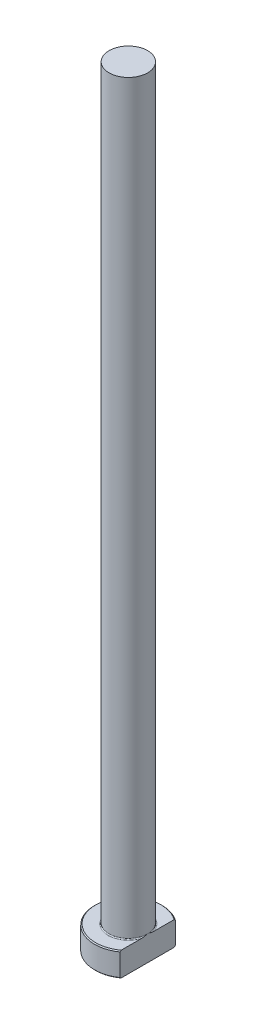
ISO-10303-21;
HEADER;
FILE_DESCRIPTION(('STEP AP214'),'2;1');
FILE_NAME('part.step','',(''),(''),'','','');
FILE_SCHEMA(('AUTOMOTIVE_DESIGN { 1 0 10303 214 1 1 1 1 }'));
ENDSEC;
DATA;
#1=APPLICATION_CONTEXT('core data for automotive mechanical design processes');
#2=APPLICATION_PROTOCOL_DEFINITION('international standard','automotive_design',2000,#1);
#3=PRODUCT_CONTEXT('',#1,'mechanical');
#4=PRODUCT('Part','Part','',(#3));
#5=PRODUCT_RELATED_PRODUCT_CATEGORY('part','',(#4));
#6=PRODUCT_DEFINITION_FORMATION('','',#4);
#7=PRODUCT_DEFINITION_CONTEXT('part definition',#1,'design');
#8=PRODUCT_DEFINITION('design','',#6,#7);
#9=PRODUCT_DEFINITION_SHAPE('','',#8);
#10=(LENGTH_UNIT() NAMED_UNIT(*) SI_UNIT(.MILLI.,.METRE.));
#11=(NAMED_UNIT(*) PLANE_ANGLE_UNIT() SI_UNIT($,.RADIAN.));
#12=(NAMED_UNIT(*) SI_UNIT($,.STERADIAN.) SOLID_ANGLE_UNIT());
#13=UNCERTAINTY_MEASURE_WITH_UNIT(LENGTH_MEASURE(1.E-05),#10,'distance_accuracy_value','');
#14=(GEOMETRIC_REPRESENTATION_CONTEXT(3) GLOBAL_UNCERTAINTY_ASSIGNED_CONTEXT((#13)) GLOBAL_UNIT_ASSIGNED_CONTEXT((#10,
#11,#12)) REPRESENTATION_CONTEXT('',''));
#15=CARTESIAN_POINT('',(0.,0.,0.));
#16=DIRECTION('',(0.,0.,1.));
#17=DIRECTION('',(1.,0.,0.));
#18=AXIS2_PLACEMENT_3D('',#15,#16,#17);
#19=CARTESIAN_POINT('',(0.,0.,0.));
#20=DIRECTION('',(0.,-1.,0.));
#21=DIRECTION('',(0.,0.,-1.));
#22=AXIS2_PLACEMENT_3D('',#19,#20,#21);
#23=PLANE('',#22);
#24=CARTESIAN_POINT('',(0.,0.,0.));
#25=DIRECTION('',(0.,-1.,0.));
#26=DIRECTION('',(0.,0.,-1.));
#27=AXIS2_PLACEMENT_3D('',#24,#25,#26);
#28=CIRCLE('',#27,6.79999999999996);
#29=CARTESIAN_POINT('',(3.99999999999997,0.,5.49909083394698));
#30=VERTEX_POINT('',#29);
#31=CARTESIAN_POINT('',(3.99999999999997,0.,-5.49909083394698));
#32=VERTEX_POINT('',#31);
#33=EDGE_CURVE('E98',#30,#32,#28,.T.);
#34=ORIENTED_EDGE('',*,*,#33,.T.);
#35=DIRECTION('',(0.,0.,1.));
#36=VECTOR('',#35,1.);
#37=CARTESIAN_POINT('',(3.99999999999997,0.,-5.74456264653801));
#38=LINE('',#37,#36);
#39=EDGE_CURVE('E83',#32,#30,#38,.T.);
#40=ORIENTED_EDGE('',*,*,#39,.T.);
#41=EDGE_LOOP('',(#34,#40));
#42=FACE_BOUND('',#41,.T.);
#43=ADVANCED_FACE('F32',(#42),#23,.T.);
#44=CARTESIAN_POINT('',(0.,259.958771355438,0.));
#45=DIRECTION('',(0.,1.,0.));
#46=DIRECTION('',(0.,0.,1.));
#47=AXIS2_PLACEMENT_3D('',#44,#45,#46);
#48=CYLINDRICAL_SURFACE('',#47,6.99999999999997);
#49=CARTESIAN_POINT('',(0.,4.80000000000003,0.));
#50=DIRECTION('',(0.,1.,0.));
#51=DIRECTION('',(0.,0.,1.));
#52=AXIS2_PLACEMENT_3D('',#49,#50,#51);
#53=CIRCLE('',#52,6.99999999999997);
#54=CARTESIAN_POINT('',(3.99999999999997,4.80000000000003,5.74456264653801));
#55=VERTEX_POINT('',#54);
#56=CARTESIAN_POINT('',(3.99999999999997,4.80000000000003,-5.74456264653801));
#57=VERTEX_POINT('',#56);
#58=EDGE_CURVE('E104',#55,#57,#53,.F.);
#59=ORIENTED_EDGE('',*,*,#58,.T.);
#60=DIRECTION('',(0.,-1.,0.));
#61=VECTOR('',#60,1.);
#62=CARTESIAN_POINT('',(3.99999999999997,160.,-5.74456264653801));
#63=LINE('',#62,#61);
#64=CARTESIAN_POINT('',(3.99999999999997,0.200000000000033,-5.74456264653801));
#65=VERTEX_POINT('',#64);
#66=EDGE_CURVE('E183',#57,#65,#63,.T.);
#67=ORIENTED_EDGE('',*,*,#66,.T.);
#68=CARTESIAN_POINT('',(0.,0.200000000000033,0.));
#69=DIRECTION('',(0.,-1.,0.));
#70=DIRECTION('',(0.,0.,-1.));
#71=AXIS2_PLACEMENT_3D('',#68,#69,#70);
#72=CIRCLE('',#71,6.99999999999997);
#73=CARTESIAN_POINT('',(3.99999999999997,0.200000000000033,5.74456264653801));
#74=VERTEX_POINT('',#73);
#75=EDGE_CURVE('E100',#65,#74,#72,.F.);
#76=ORIENTED_EDGE('',*,*,#75,.T.);
#77=DIRECTION('',(0.,-1.,0.));
#78=VECTOR('',#77,1.);
#79=CARTESIAN_POINT('',(3.99999999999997,160.,5.74456264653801));
#80=LINE('',#79,#78);
#81=EDGE_CURVE('E93',#55,#74,#80,.T.);
#82=ORIENTED_EDGE('',*,*,#81,.F.);
#83=EDGE_LOOP('',(#59,#67,#76,#82));
#84=FACE_BOUND('',#83,.T.);
#85=ADVANCED_FACE('F158',(#84),#48,.T.);
#86=CARTESIAN_POINT('',(-6.99999999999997,5.,0.));
#87=DIRECTION('',(0.,1.,0.));
#88=DIRECTION('',(0.,0.,1.));
#89=AXIS2_PLACEMENT_3D('',#86,#87,#88);
#90=PLANE('',#89);
#91=CARTESIAN_POINT('',(0.,5.,0.));
#92=DIRECTION('',(0.,1.,0.));
#93=DIRECTION('',(0.,0.,1.));
#94=AXIS2_PLACEMENT_3D('',#91,#92,#93);
#95=CIRCLE('',#94,6.80000000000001);
#96=CARTESIAN_POINT('',(3.99999999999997,5.,-5.49909083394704));
#97=VERTEX_POINT('',#96);
#98=CARTESIAN_POINT('',(3.99999999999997,5.,5.49909083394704));
#99=VERTEX_POINT('',#98);
#100=EDGE_CURVE('E178',#97,#99,#95,.T.);
#101=ORIENTED_EDGE('',*,*,#100,.T.);
#102=DIRECTION('',(0.,0.,-1.));
#103=VECTOR('',#102,1.);
#104=CARTESIAN_POINT('',(3.99999999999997,5.,0.));
#105=LINE('',#104,#103);
#106=CARTESIAN_POINT('',(3.99999999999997,4.99999999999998,1.28062484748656));
#107=VERTEX_POINT('',#106);
#108=EDGE_CURVE('E57',#99,#107,#105,.T.);
#109=ORIENTED_EDGE('',*,*,#108,.T.);
#110=CARTESIAN_POINT('',(0.,5.,0.));
#111=DIRECTION('',(0.,1.,0.));
#112=DIRECTION('',(0.,0.,1.));
#113=AXIS2_PLACEMENT_3D('',#110,#111,#112);
#114=CIRCLE('',#113,4.19999999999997);
#115=CARTESIAN_POINT('',(3.99999999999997,4.99999999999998,-1.28062484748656));
#116=VERTEX_POINT('',#115);
#117=EDGE_CURVE('E107',#107,#116,#114,.F.);
#118=ORIENTED_EDGE('',*,*,#117,.T.);
#119=EDGE_CURVE('E136',#116,#97,#105,.T.);
#120=ORIENTED_EDGE('',*,*,#119,.T.);
#121=EDGE_LOOP('',(#101,#109,#118,#120));
#122=FACE_BOUND('',#121,.T.);
#123=ADVANCED_FACE('F147',(#122),#90,.T.);
#124=CARTESIAN_POINT('',(0.,5.,0.));
#125=DIRECTION('',(0.,-1.,0.));
#126=DIRECTION('',(0.,0.,-1.));
#127=AXIS2_PLACEMENT_3D('',#124,#125,#126);
#128=CONICAL_SURFACE('',#127,6.8,0.785398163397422);
#129=ORIENTED_EDGE('',*,*,#58,.F.);
#130=CARTESIAN_POINT('',(3.99999999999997,-1.4571284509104,12.6392822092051));
#131=CARTESIAN_POINT('',(3.99999999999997,-1.24364466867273,12.4153556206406));
#132=CARTESIAN_POINT('',(3.99999999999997,-1.0304243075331,12.1911774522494));
#133=CARTESIAN_POINT('',(3.99999999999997,-0.604617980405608,11.7422167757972));
#134=CARTESIAN_POINT('',(3.99999999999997,-0.392032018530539,11.5174342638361));
#135=CARTESIAN_POINT('',(3.99999999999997,0.0324624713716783,11.0670952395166));
#136=CARTESIAN_POINT('',(3.99999999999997,0.244370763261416,10.8415385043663));
#137=CARTESIAN_POINT('',(3.99999999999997,0.667290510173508,10.3895875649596));
#138=CARTESIAN_POINT('',(3.99999999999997,0.878301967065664,10.1631933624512));
#139=CARTESIAN_POINT('',(3.99999999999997,1.5138537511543,9.4781012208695));
#140=CARTESIAN_POINT('',(3.99999999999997,1.93676291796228,9.01788214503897));
#141=CARTESIAN_POINT('',(3.99999999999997,2.56612335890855,8.32309905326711));
#142=CARTESIAN_POINT('',(3.99999999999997,2.77505666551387,8.09078457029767));
#143=CARTESIAN_POINT('',(3.99999999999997,3.19080254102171,7.62426940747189));
#144=CARTESIAN_POINT('',(3.99999999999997,3.39761512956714,7.39006874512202));
#145=CARTESIAN_POINT('',(3.99999999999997,3.87870763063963,6.83891844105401));
#146=CARTESIAN_POINT('',(3.99999999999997,4.15190978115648,6.52102188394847));
#147=CARTESIAN_POINT('',(3.99999999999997,4.55642425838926,6.03960901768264));
#148=CARTESIAN_POINT('',(3.99999999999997,4.69041050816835,5.87833992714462));
#149=CARTESIAN_POINT('',(3.99999999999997,4.95616531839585,5.55398469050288));
#150=CARTESIAN_POINT('',(3.99999999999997,5.087933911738,5.39089857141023));
#151=CARTESIAN_POINT('',(3.99999999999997,5.34841712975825,5.06288801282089));
#152=CARTESIAN_POINT('',(3.99999999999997,5.4771378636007,4.89796843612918));
#153=CARTESIAN_POINT('',(3.99999999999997,5.73107494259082,4.56545535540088));
#154=CARTESIAN_POINT('',(3.99999999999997,5.85629144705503,4.39786197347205));
#155=CARTESIAN_POINT('',(3.99999999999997,6.1021146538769,4.05948444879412));
#156=CARTESIAN_POINT('',(3.99999999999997,6.22272435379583,3.88870249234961));
#157=CARTESIAN_POINT('',(3.99999999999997,6.45796076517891,3.54308312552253));
#158=CARTESIAN_POINT('',(3.99999999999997,6.57258867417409,3.36824653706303));
#159=CARTESIAN_POINT('',(3.99999999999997,6.76866603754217,3.05381396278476));
#160=CARTESIAN_POINT('',(3.99999999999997,6.85173773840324,2.91523359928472));
#161=CARTESIAN_POINT('',(3.99999999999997,7.01174537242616,2.63451965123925));
#162=CARTESIAN_POINT('',(3.99999999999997,7.08868042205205,2.49238555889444));
#163=CARTESIAN_POINT('',(3.99999999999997,7.23459437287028,2.20416961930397));
#164=CARTESIAN_POINT('',(3.99999999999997,7.3035783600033,2.05809037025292));
#165=CARTESIAN_POINT('',(3.99999999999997,7.43135520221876,1.761517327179));
#166=CARTESIAN_POINT('',(3.99999999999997,7.49015114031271,1.61102488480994));
#167=CARTESIAN_POINT('',(3.99999999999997,7.58249315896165,1.34142099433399));
#168=CARTESIAN_POINT('',(3.99999999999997,7.61872660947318,1.22323501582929));
#169=CARTESIAN_POINT('',(3.99999999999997,7.68223354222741,0.984492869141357));
#170=CARTESIAN_POINT('',(3.99999999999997,7.70951040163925,0.863937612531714));
#171=CARTESIAN_POINT('',(3.99999999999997,7.7537791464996,0.621342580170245));
#172=CARTESIAN_POINT('',(3.99999999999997,7.77080509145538,0.499309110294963));
#173=CARTESIAN_POINT('',(3.99999999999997,7.79378778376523,0.254194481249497));
#174=CARTESIAN_POINT('',(3.99999999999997,7.79974523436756,0.131113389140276));
#175=CARTESIAN_POINT('',(3.99999999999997,7.80023957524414,-0.115517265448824));
#176=CARTESIAN_POINT('',(3.99999999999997,7.79473514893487,-0.239066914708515));
#177=CARTESIAN_POINT('',(3.99999999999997,7.77255119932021,-0.48514894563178));
#178=CARTESIAN_POINT('',(3.99999999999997,7.75587091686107,-0.607681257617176));
#179=CARTESIAN_POINT('',(3.99999999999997,7.71218353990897,-0.851269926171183));
#180=CARTESIAN_POINT('',(3.99999999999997,7.68514362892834,-0.972320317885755));
#181=CARTESIAN_POINT('',(3.99999999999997,7.62201202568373,-1.21200276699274));
#182=CARTESIAN_POINT('',(3.99999999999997,7.5859196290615,-1.33063463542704));
#183=CARTESIAN_POINT('',(3.99999999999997,7.45980070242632,-1.70122439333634));
#184=CARTESIAN_POINT('',(3.99999999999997,7.35572950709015,-1.94843335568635));
#185=CARTESIAN_POINT('',(3.99999999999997,7.18186715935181,-2.31048534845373));
#186=CARTESIAN_POINT('',(3.99999999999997,7.12087684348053,-2.42983561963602));
#187=CARTESIAN_POINT('',(3.99999999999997,6.99403531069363,-2.66593629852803));
#188=CARTESIAN_POINT('',(3.99999999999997,6.92818466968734,-2.78268701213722));
#189=CARTESIAN_POINT('',(3.99999999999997,6.79157875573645,-3.01550895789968));
#190=CARTESIAN_POINT('',(3.99999999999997,6.72076681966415,-3.13154660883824));
#191=CARTESIAN_POINT('',(3.99999999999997,6.57583116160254,-3.36153379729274));
#192=CARTESIAN_POINT('',(3.99999999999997,6.50170736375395,-3.47548328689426));
#193=CARTESIAN_POINT('',(3.99999999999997,6.35080982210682,-3.70145107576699));
#194=CARTESIAN_POINT('',(3.99999999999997,6.27403866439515,-3.81347110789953));
#195=CARTESIAN_POINT('',(3.99999999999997,6.11824120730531,-4.0359231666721));
#196=CARTESIAN_POINT('',(3.99999999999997,6.03921496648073,-4.14635523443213));
#197=CARTESIAN_POINT('',(3.99999999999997,5.81506547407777,-4.45397159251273));
#198=CARTESIAN_POINT('',(3.99999999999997,5.66782256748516,-4.64961120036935));
#199=CARTESIAN_POINT('',(3.99999999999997,5.36880597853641,-5.0374060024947));
#200=CARTESIAN_POINT('',(3.99999999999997,5.21703183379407,-5.22956083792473));
#201=CARTESIAN_POINT('',(3.99999999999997,4.90999105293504,-5.61115465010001));
#202=CARTESIAN_POINT('',(3.99999999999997,4.75472331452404,-5.80059273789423));
#203=CARTESIAN_POINT('',(3.99999999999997,4.44150758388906,-6.17724364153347));
#204=CARTESIAN_POINT('',(3.99999999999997,4.28355951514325,-6.36445639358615));
#205=CARTESIAN_POINT('',(3.99999999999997,3.96525805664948,-6.73740614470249));
#206=CARTESIAN_POINT('',(3.99999999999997,3.80490084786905,-6.92313987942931));
#207=CARTESIAN_POINT('',(3.99999999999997,3.48247055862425,-7.29311320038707));
#208=CARTESIAN_POINT('',(3.99999999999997,3.32039746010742,-7.47735277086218));
#209=CARTESIAN_POINT('',(3.99999999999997,2.83216188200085,-8.02814826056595));
#210=CARTESIAN_POINT('',(3.99999999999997,2.50391696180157,-8.39285790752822));
#211=CARTESIAN_POINT('',(3.99999999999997,1.8751207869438,-9.08414492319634));
#212=CARTESIAN_POINT('',(3.99999999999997,1.57491666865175,-9.4110392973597));
#213=CARTESIAN_POINT('',(3.99999999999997,0.97215328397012,-10.0626830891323));
#214=CARTESIAN_POINT('',(3.99999999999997,0.669593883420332,-10.387432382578));
#215=CARTESIAN_POINT('',(3.99999999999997,0.0637759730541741,-11.0341169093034));
#216=CARTESIAN_POINT('',(3.99999999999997,-0.239476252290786,-11.3560580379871));
#217=CARTESIAN_POINT('',(3.99999999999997,-0.847356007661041,-11.9985921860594));
#218=CARTESIAN_POINT('',(3.99999999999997,-1.15198342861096,-12.3191853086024));
#219=CARTESIAN_POINT('',(3.99999999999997,-1.4571284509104,-12.6392822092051));
#220=B_SPLINE_CURVE_WITH_KNOTS('',3,(#130,#131,#132,#133,#134,#135,#136,#137,#138,#139,#140,
#141,#142,#143,#144,#145,#146,#147,#148,#149,#150,#151,#152,#153,#154,#155,#156,#157,#158,#159,
#160,#161,#162,#163,#164,#165,#166,#167,#168,#169,#170,#171,#172,#173,#174,#175,#176,#177,#178,
#179,#180,#181,#182,#183,#184,#185,#186,#187,#188,#189,#190,#191,#192,#193,#194,#195,#196,#197,
#198,#199,#200,#201,#202,#203,#204,#205,#206,#207,#208,#209,#210,#211,#212,#213,#214,#215,#216,
#217,#218,#219),.UNSPECIFIED.,.F.,.F.,(4,2,2,2,2,2,2,2,2,2,2,2,2,2,2,2,2,2,2,2,2,2,2,2,2,2,2,2,
2,2,2,2,2,2,2,2,2,2,2,2,2,2,2,2,4),(0.,0.928152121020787,1.85631024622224,2.78476262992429,
3.71321307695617,5.58823033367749,6.52556078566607,7.46288254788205,8.7202857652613,
9.34927045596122,9.97824580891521,10.6058302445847,11.2333861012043,11.8605264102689,
12.4875406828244,12.972136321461,13.4568016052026,13.9411551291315,14.4253618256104,
14.7959147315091,15.1663277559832,15.5355031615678,15.904655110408,16.2751400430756,
16.6456501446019,17.0173437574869,17.3890663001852,18.1913996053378,18.5934522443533,
18.9954573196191,19.4032100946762,19.8109722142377,20.2183467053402,20.6257106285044,
21.3601838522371,22.0947322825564,22.8295158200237,23.5643203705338,24.3004480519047,
25.036583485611,26.508549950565,27.8400191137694,29.1715646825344,30.4983881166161,
31.8251080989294),.UNSPECIFIED.);
#221=EDGE_CURVE('E135',#55,#99,#220,.T.);
#222=ORIENTED_EDGE('',*,*,#221,.T.);
#223=ORIENTED_EDGE('',*,*,#100,.F.);
#224=EDGE_CURVE('E127',#97,#57,#220,.T.);
#225=ORIENTED_EDGE('',*,*,#224,.T.);
#226=EDGE_LOOP('',(#129,#222,#223,#225));
#227=FACE_BOUND('',#226,.T.);
#228=ADVANCED_FACE('F143',(#227),#128,.T.);
#229=CARTESIAN_POINT('',(0.,0.200000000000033,0.));
#230=DIRECTION('',(0.,1.,0.));
#231=DIRECTION('',(0.,0.,1.));
#232=AXIS2_PLACEMENT_3D('',#229,#230,#231);
#233=CONICAL_SURFACE('',#232,6.99999999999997,0.785398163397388);
#234=ORIENTED_EDGE('',*,*,#75,.F.);
#235=CARTESIAN_POINT('',(3.99999999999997,6.4571284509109,-12.6392822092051));
#236=CARTESIAN_POINT('',(3.99999999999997,6.24364466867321,-12.4153556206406));
#237=CARTESIAN_POINT('',(3.99999999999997,6.03042430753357,-12.1911774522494));
#238=CARTESIAN_POINT('',(3.99999999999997,5.60461798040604,-11.7422167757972));
#239=CARTESIAN_POINT('',(3.99999999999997,5.39203201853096,-11.5174342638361));
#240=CARTESIAN_POINT('',(3.99999999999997,4.96753752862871,-11.0670952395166));
#241=CARTESIAN_POINT('',(3.99999999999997,4.75562923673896,-10.8415385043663));
#242=CARTESIAN_POINT('',(3.99999999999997,4.33270948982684,-10.3895875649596));
#243=CARTESIAN_POINT('',(3.99999999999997,4.12169803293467,-10.1631933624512));
#244=CARTESIAN_POINT('',(3.99999999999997,3.48614624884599,-9.47810122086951));
#245=CARTESIAN_POINT('',(3.99999999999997,3.06323708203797,-9.01788214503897));
#246=CARTESIAN_POINT('',(3.99999999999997,2.43387664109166,-8.32309905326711));
#247=CARTESIAN_POINT('',(3.99999999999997,2.22494333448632,-8.09078457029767));
#248=CARTESIAN_POINT('',(3.99999999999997,1.80919745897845,-7.62426940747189));
#249=CARTESIAN_POINT('',(3.99999999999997,1.60238487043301,-7.39006874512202));
#250=CARTESIAN_POINT('',(3.99999999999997,1.12129236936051,-6.83891844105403));
#251=CARTESIAN_POINT('',(3.99999999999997,0.848090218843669,-6.52102188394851));
#252=CARTESIAN_POINT('',(3.99999999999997,0.443575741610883,-6.03960901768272));
#253=CARTESIAN_POINT('',(3.99999999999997,0.3095894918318,-5.87833992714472));
#254=CARTESIAN_POINT('',(3.99999999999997,0.0438346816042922,-5.553984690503));
#255=CARTESIAN_POINT('',(3.99999999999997,-0.0879339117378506,-5.39089857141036));
#256=CARTESIAN_POINT('',(3.99999999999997,-0.348417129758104,-5.06288801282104));
#257=CARTESIAN_POINT('',(3.99999999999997,-0.477137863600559,-4.89796843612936));
#258=CARTESIAN_POINT('',(3.99999999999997,-0.731074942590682,-4.56545535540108));
#259=CARTESIAN_POINT('',(3.99999999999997,-0.856291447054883,-4.39786197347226));
#260=CARTESIAN_POINT('',(3.99999999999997,-1.10211465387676,-4.05948444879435));
#261=CARTESIAN_POINT('',(3.99999999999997,-1.22272435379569,-3.88870249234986));
#262=CARTESIAN_POINT('',(3.99999999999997,-1.45796076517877,-3.54308312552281));
#263=CARTESIAN_POINT('',(3.99999999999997,-1.57258867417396,-3.36824653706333));
#264=CARTESIAN_POINT('',(3.99999999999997,-1.76866603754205,-3.05381396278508));
#265=CARTESIAN_POINT('',(3.99999999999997,-1.85173773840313,-2.91523359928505));
#266=CARTESIAN_POINT('',(3.99999999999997,-2.01174537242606,-2.6345196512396));
#267=CARTESIAN_POINT('',(3.99999999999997,-2.08868042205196,-2.49238555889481));
#268=CARTESIAN_POINT('',(3.99999999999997,-2.2345943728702,-2.20416961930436));
#269=CARTESIAN_POINT('',(3.99999999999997,-2.30357836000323,-2.05809037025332));
#270=CARTESIAN_POINT('',(3.99999999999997,-2.43135520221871,-1.76151732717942));
#271=CARTESIAN_POINT('',(3.99999999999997,-2.49015114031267,-1.61102488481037));
#272=CARTESIAN_POINT('',(3.99999999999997,-2.58249315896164,-1.34142099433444));
#273=CARTESIAN_POINT('',(3.99999999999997,-2.61872660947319,-1.22323501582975));
#274=CARTESIAN_POINT('',(3.99999999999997,-2.68223354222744,-0.984492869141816));
#275=CARTESIAN_POINT('',(3.99999999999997,-2.70951040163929,-0.863937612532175));
#276=CARTESIAN_POINT('',(3.99999999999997,-2.75377914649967,-0.621342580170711));
#277=CARTESIAN_POINT('',(3.99999999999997,-2.77080509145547,-0.49930911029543));
#278=CARTESIAN_POINT('',(3.99999999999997,-2.79378778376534,-0.254194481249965));
#279=CARTESIAN_POINT('',(3.99999999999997,-2.7997452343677,-0.131113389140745));
#280=CARTESIAN_POINT('',(3.99999999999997,-2.8002395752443,0.115517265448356));
#281=CARTESIAN_POINT('',(3.99999999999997,-2.79473514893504,0.23906691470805));
#282=CARTESIAN_POINT('',(3.99999999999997,-2.77255119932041,0.485148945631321));
#283=CARTESIAN_POINT('',(3.99999999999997,-2.75587091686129,0.607681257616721));
#284=CARTESIAN_POINT('',(3.99999999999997,-2.71218353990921,0.851269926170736));
#285=CARTESIAN_POINT('',(3.99999999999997,-2.68514362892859,0.972320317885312));
#286=CARTESIAN_POINT('',(3.99999999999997,-2.62201202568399,1.21200276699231));
#287=CARTESIAN_POINT('',(3.99999999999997,-2.58591962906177,1.3306346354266));
#288=CARTESIAN_POINT('',(3.99999999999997,-2.45980070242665,1.70122439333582));
#289=CARTESIAN_POINT('',(3.99999999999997,-2.35572950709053,1.94843335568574));
#290=CARTESIAN_POINT('',(3.99999999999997,-2.18186715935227,2.310485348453));
#291=CARTESIAN_POINT('',(3.99999999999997,-2.12087684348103,2.42983561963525));
#292=CARTESIAN_POINT('',(3.99999999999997,-1.9940353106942,2.66593629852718));
#293=CARTESIAN_POINT('',(3.99999999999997,-1.92818466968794,2.78268701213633));
#294=CARTESIAN_POINT('',(3.99999999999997,-1.79157875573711,3.01550895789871));
#295=CARTESIAN_POINT('',(3.99999999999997,-1.72076681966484,3.13154660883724));
#296=CARTESIAN_POINT('',(3.99999999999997,-1.5758311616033,3.36153379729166));
#297=CARTESIAN_POINT('',(3.99999999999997,-1.50170736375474,3.47548328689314));
#298=CARTESIAN_POINT('',(3.99999999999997,-1.35080982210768,3.7014510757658));
#299=CARTESIAN_POINT('',(3.99999999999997,-1.27403866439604,3.81347110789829));
#300=CARTESIAN_POINT('',(3.99999999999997,-1.11824120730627,4.0359231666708));
#301=CARTESIAN_POINT('',(3.99999999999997,-1.03921496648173,4.14635523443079));
#302=CARTESIAN_POINT('',(3.99999999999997,-0.815065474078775,4.4539715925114));
#303=CARTESIAN_POINT('',(3.99999999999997,-0.667822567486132,4.64961120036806));
#304=CARTESIAN_POINT('',(3.99999999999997,-0.368805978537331,5.03740600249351));
#305=CARTESIAN_POINT('',(3.99999999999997,-0.217031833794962,5.22956083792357));
#306=CARTESIAN_POINT('',(3.99999999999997,0.090008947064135,5.61115465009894));
#307=CARTESIAN_POINT('',(3.99999999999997,0.245276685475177,5.8005927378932));
#308=CARTESIAN_POINT('',(3.99999999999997,0.558492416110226,6.17724364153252));
#309=CARTESIAN_POINT('',(3.99999999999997,0.716440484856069,6.36445639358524));
#310=CARTESIAN_POINT('',(3.99999999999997,1.03474194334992,6.73740614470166));
#311=CARTESIAN_POINT('',(3.99999999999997,1.19509915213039,6.92313987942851));
#312=CARTESIAN_POINT('',(3.99999999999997,1.51752944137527,7.29311320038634));
#313=CARTESIAN_POINT('',(3.99999999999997,1.67960253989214,7.4773527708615));
#314=CARTESIAN_POINT('',(3.99999999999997,2.16783811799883,8.02814826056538));
#315=CARTESIAN_POINT('',(3.99999999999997,2.4960830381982,8.39285790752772));
#316=CARTESIAN_POINT('',(3.99999999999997,3.12487921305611,9.08414492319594));
#317=CARTESIAN_POINT('',(3.99999999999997,3.4250833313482,9.41103929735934));
#318=CARTESIAN_POINT('',(3.99999999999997,4.02784671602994,10.062683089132));
#319=CARTESIAN_POINT('',(3.99999999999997,4.33040611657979,10.3874323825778));
#320=CARTESIAN_POINT('',(3.99999999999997,4.93622402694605,11.0341169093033));
#321=CARTESIAN_POINT('',(3.99999999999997,5.23947625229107,11.3560580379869));
#322=CARTESIAN_POINT('',(3.99999999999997,5.84735600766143,11.9985921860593));
#323=CARTESIAN_POINT('',(3.99999999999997,6.1519834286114,12.3191853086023));
#324=CARTESIAN_POINT('',(3.99999999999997,6.45712845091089,12.6392822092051));
#325=B_SPLINE_CURVE_WITH_KNOTS('',3,(#235,#236,#237,#238,#239,#240,#241,#242,#243,#244,#245,
#246,#247,#248,#249,#250,#251,#252,#253,#254,#255,#256,#257,#258,#259,#260,#261,#262,#263,#264,
#265,#266,#267,#268,#269,#270,#271,#272,#273,#274,#275,#276,#277,#278,#279,#280,#281,#282,#283,
#284,#285,#286,#287,#288,#289,#290,#291,#292,#293,#294,#295,#296,#297,#298,#299,#300,#301,#302,
#303,#304,#305,#306,#307,#308,#309,#310,#311,#312,#313,#314,#315,#316,#317,#318,#319,#320,#321,
#322,#323,#324),.UNSPECIFIED.,.F.,.F.,(4,2,2,2,2,2,2,2,2,2,2,2,2,2,2,2,2,2,2,2,2,2,2,2,2,2,2,2,
2,2,2,2,2,2,2,2,2,2,2,2,2,2,2,2,4),(0.,0.928152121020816,1.85631024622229,2.78476262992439,
3.71321307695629,5.58823033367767,6.52556078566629,7.46288254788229,8.72028576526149,
9.34927045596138,9.97824580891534,10.6058302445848,11.2333861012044,11.860526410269,
12.4875406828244,12.972136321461,13.4568016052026,13.9411551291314,14.4253618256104,
14.795914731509,15.1663277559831,15.5355031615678,15.9046551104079,16.2751400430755,
16.6456501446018,17.0173437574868,17.3890663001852,18.1913996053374,18.5934522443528,
18.9954573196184,19.4032100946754,19.8109722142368,20.2183467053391,20.6257106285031,
21.360183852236,22.0947322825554,22.8295158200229,23.5643203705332,24.3004480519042,
25.0365834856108,26.5085499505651,27.8400191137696,29.1715646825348,30.4983881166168,
31.8251080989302),.UNSPECIFIED.);
#326=EDGE_CURVE('E86',#65,#32,#325,.T.);
#327=ORIENTED_EDGE('',*,*,#326,.T.);
#328=ORIENTED_EDGE('',*,*,#33,.F.);
#329=EDGE_CURVE('E89',#30,#74,#325,.T.);
#330=ORIENTED_EDGE('',*,*,#329,.T.);
#331=EDGE_LOOP('',(#234,#327,#328,#330));
#332=FACE_BOUND('',#331,.T.);
#333=ADVANCED_FACE('F97',(#332),#233,.T.);
#334=CARTESIAN_POINT('',(0.,5.19999999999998,0.));
#335=DIRECTION('',(0.,1.,0.));
#336=DIRECTION('',(0.,0.,1.));
#337=AXIS2_PLACEMENT_3D('',#334,#335,#336);
#338=TOROIDAL_SURFACE('',#337,4.19999999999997,0.2);
#339=CARTESIAN_POINT('',(3.99999999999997,5.19999999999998,0.));
#340=CARTESIAN_POINT('',(3.99999999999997,5.20000051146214,6.55036346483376E-12));
#341=CARTESIAN_POINT('',(3.99999999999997,5.20000102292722,-2.33849506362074E-07));
#342=CARTESIAN_POINT('',(3.99999999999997,5.20000197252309,-8.59106878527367E-07));
#343=CARTESIAN_POINT('',(3.99999999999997,5.20000239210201,-1.26721104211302E-06));
#344=CARTESIAN_POINT('',(3.99999999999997,5.2000032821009,-2.25074272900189E-06));
#345=CARTESIAN_POINT('',(3.99999999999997,5.20000373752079,-2.84212509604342E-06));
#346=CARTESIAN_POINT('',(3.99999999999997,5.20000453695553,-4.0532804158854E-06));
#347=CARTESIAN_POINT('',(3.99999999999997,5.20000488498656,-4.67066373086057E-06));
#348=CARTESIAN_POINT('',(3.99999999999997,5.20000621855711,-7.11716595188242E-06));
#349=CARTESIAN_POINT('',(3.99999999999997,5.20000713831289,-8.9855846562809E-06));
#350=CARTESIAN_POINT('',(3.99999999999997,5.20000861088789,-1.26418241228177E-05));
#351=CARTESIAN_POINT('',(3.99999999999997,5.20000919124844,-1.44189478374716E-05));
#352=CARTESIAN_POINT('',(3.99999999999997,5.20001169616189,-2.20915834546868E-05));
#353=CARTESIAN_POINT('',(3.99999999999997,5.20001361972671,-2.79894745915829E-05));
#354=CARTESIAN_POINT('',(3.99999999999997,5.20001638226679,-3.90228530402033E-05));
#355=CARTESIAN_POINT('',(3.99999999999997,5.20001734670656,-4.41264575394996E-05));
#356=CARTESIAN_POINT('',(3.99999999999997,5.20002447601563,-8.24800894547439E-05));
#357=CARTESIAN_POINT('',(3.99999999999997,5.20003000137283,-0.000115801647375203));
#358=CARTESIAN_POINT('',(3.99999999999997,5.20005417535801,-0.000248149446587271));
#359=CARTESIAN_POINT('',(3.99999999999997,5.20007711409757,-0.00034639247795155));
#360=CARTESIAN_POINT('',(3.99999999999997,5.20016695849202,-0.000737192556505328));
#361=CARTESIAN_POINT('',(3.99999999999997,5.2002311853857,-0.00103015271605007));
#362=CARTESIAN_POINT('',(3.99999999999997,5.20048943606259,-0.00220000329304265));
#363=CARTESIAN_POINT('',(3.99999999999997,5.20068689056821,-0.00307635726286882));
#364=CARTESIAN_POINT('',(3.99999999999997,5.2015124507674,-0.00674945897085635));
#365=CARTESIAN_POINT('',(3.99999999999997,5.20213623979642,-0.00954688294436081));
#366=CARTESIAN_POINT('',(3.99999999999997,5.21069858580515,-0.0479346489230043));
#367=CARTESIAN_POINT('',(3.99999999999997,5.21866411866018,-0.083521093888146));
#368=CARTESIAN_POINT('',(3.99999999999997,5.23536251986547,-0.158673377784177));
#369=CARTESIAN_POINT('',(3.99999999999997,5.24408230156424,-0.198242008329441));
#370=CARTESIAN_POINT('',(3.99999999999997,5.25875222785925,-0.265746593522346));
#371=CARTESIAN_POINT('',(3.99999999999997,5.264760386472,-0.293669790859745));
#372=CARTESIAN_POINT('',(3.99999999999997,5.27645424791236,-0.348796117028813));
#373=CARTESIAN_POINT('',(3.99999999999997,5.2821442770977,-0.375998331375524));
#374=CARTESIAN_POINT('',(3.99999999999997,5.30043795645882,-0.465036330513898));
#375=CARTESIAN_POINT('',(3.99999999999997,5.31263876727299,-0.526956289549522));
#376=CARTESIAN_POINT('',(3.99999999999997,5.33561275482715,-0.65168218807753));
#377=CARTESIAN_POINT('',(3.99999999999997,5.34637105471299,-0.714490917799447));
#378=CARTESIAN_POINT('',(3.99999999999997,5.36658245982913,-0.846543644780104));
#379=CARTESIAN_POINT('',(3.99999999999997,5.37580902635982,-0.915823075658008));
#380=CARTESIAN_POINT('',(3.99999999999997,5.39039845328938,-1.05460878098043));
#381=CARTESIAN_POINT('',(3.99999999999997,5.39577328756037,-1.12411367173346));
#382=CARTESIAN_POINT('',(3.99999999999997,5.39959291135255,-1.22750409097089));
#383=CARTESIAN_POINT('',(3.99999999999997,5.40018074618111,-1.26130913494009));
#384=CARTESIAN_POINT('',(3.99999999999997,5.39972074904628,-1.32890426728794));
#385=CARTESIAN_POINT('',(3.99999999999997,5.39867346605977,-1.36269435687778));
#386=CARTESIAN_POINT('',(3.99999999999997,5.39455571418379,-1.42954089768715));
#387=CARTESIAN_POINT('',(3.99999999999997,5.39152235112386,-1.46259952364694));
#388=CARTESIAN_POINT('',(3.99999999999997,5.38286512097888,-1.52835908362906));
#389=CARTESIAN_POINT('',(3.99999999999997,5.37724516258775,-1.56106048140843));
#390=CARTESIAN_POINT('',(3.99999999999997,5.36402263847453,-1.61846409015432));
#391=CARTESIAN_POINT('',(3.99999999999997,5.35713757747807,-1.64332989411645));
#392=CARTESIAN_POINT('',(3.99999999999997,5.34027199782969,-1.69212725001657));
#393=CARTESIAN_POINT('',(3.99999999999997,5.33028876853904,-1.7160579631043));
#394=CARTESIAN_POINT('',(3.99999999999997,5.31168601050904,-1.75008824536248));
#395=CARTESIAN_POINT('',(3.99999999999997,5.30485398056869,-1.76115159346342));
#396=CARTESIAN_POINT('',(3.99999999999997,5.28960114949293,-1.78210611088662));
#397=CARTESIAN_POINT('',(3.99999999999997,5.28118962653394,-1.79200360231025));
#398=CARTESIAN_POINT('',(3.99999999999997,5.26737388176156,-1.80493475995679));
#399=CARTESIAN_POINT('',(3.99999999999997,5.26276322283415,-1.80881084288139));
#400=CARTESIAN_POINT('',(3.99999999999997,5.25306023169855,-1.81592390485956));
#401=CARTESIAN_POINT('',(3.99999999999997,5.24796771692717,-1.81916064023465));
#402=CARTESIAN_POINT('',(3.99999999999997,5.23724406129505,-1.82480514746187));
#403=CARTESIAN_POINT('',(3.99999999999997,5.23160666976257,-1.82720134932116));
#404=CARTESIAN_POINT('',(3.99999999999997,5.219971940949,-1.83083611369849));
#405=CARTESIAN_POINT('',(3.99999999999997,5.21397550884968,-1.83207746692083));
#406=CARTESIAN_POINT('',(3.99999999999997,5.20263132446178,-1.83315692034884));
#407=CARTESIAN_POINT('',(3.99999999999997,5.19729868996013,-1.8331541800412));
#408=CARTESIAN_POINT('',(3.99999999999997,5.18672944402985,-1.83214057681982));
#409=CARTESIAN_POINT('',(3.99999999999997,5.18149289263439,-1.83112910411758));
#410=CARTESIAN_POINT('',(3.99999999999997,5.17078487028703,-1.82806907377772));
#411=CARTESIAN_POINT('',(3.99999999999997,5.16533999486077,-1.82592931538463));
#412=CARTESIAN_POINT('',(3.99999999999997,5.1548729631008,-1.82079411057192));
#413=CARTESIAN_POINT('',(3.99999999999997,5.14985146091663,-1.81779737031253));
#414=CARTESIAN_POINT('',(3.99999999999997,5.13773920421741,-1.80942140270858));
#415=CARTESIAN_POINT('',(3.99999999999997,5.13094534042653,-1.80361715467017));
#416=CARTESIAN_POINT('',(3.99999999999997,5.11830005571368,-1.79106454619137));
#417=CARTESIAN_POINT('',(3.99999999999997,5.11245134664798,-1.78431356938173));
#418=CARTESIAN_POINT('',(3.99999999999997,5.09656788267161,-1.76377799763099));
#419=CARTESIAN_POINT('',(3.99999999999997,5.08757958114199,-1.74919341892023));
#420=CARTESIAN_POINT('',(3.99999999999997,5.07165230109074,-1.71899459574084));
#421=CARTESIAN_POINT('',(3.99999999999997,5.064716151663,-1.70337896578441));
#422=CARTESIAN_POINT('',(3.99999999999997,5.04964646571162,-1.66459665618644));
#423=CARTESIAN_POINT('',(3.99999999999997,5.04232016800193,-1.64111968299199));
#424=CARTESIAN_POINT('',(3.99999999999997,5.02986383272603,-1.59357415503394));
#425=CARTESIAN_POINT('',(3.99999999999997,5.02473853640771,-1.56950444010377));
#426=CARTESIAN_POINT('',(3.99999999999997,5.0161032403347,-1.52067485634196));
#427=CARTESIAN_POINT('',(3.99999999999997,5.01262117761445,-1.49591014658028));
#428=CARTESIAN_POINT('',(3.99999999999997,5.00704256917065,-1.44626562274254));
#429=CARTESIAN_POINT('',(3.99999999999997,5.00494421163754,-1.42138600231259));
#430=CARTESIAN_POINT('',(3.99999999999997,5.00075077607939,-1.35341124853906));
#431=CARTESIAN_POINT('',(3.99999999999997,4.99977133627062,-1.31024782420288));
#432=CARTESIAN_POINT('',(3.99999999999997,5.00031303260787,-1.22392963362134));
#433=CARTESIAN_POINT('',(3.99999999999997,5.00183577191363,-1.18077489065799));
#434=CARTESIAN_POINT('',(3.99999999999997,5.00931890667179,-1.05109835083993));
#435=CARTESIAN_POINT('',(3.99999999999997,5.01820648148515,-0.964749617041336));
#436=CARTESIAN_POINT('',(3.99999999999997,5.03989342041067,-0.800200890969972));
#437=CARTESIAN_POINT('',(3.99999999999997,5.05228816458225,-0.721941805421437));
#438=CARTESIAN_POINT('',(3.99999999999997,5.07962880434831,-0.566748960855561));
#439=CARTESIAN_POINT('',(3.99999999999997,5.09454562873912,-0.4898100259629));
#440=CARTESIAN_POINT('',(3.99999999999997,5.115946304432,-0.385191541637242));
#441=CARTESIAN_POINT('',(3.99999999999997,5.12174621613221,-0.357366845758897));
#442=CARTESIAN_POINT('',(3.99999999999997,5.13367824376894,-0.300962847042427));
#443=CARTESIAN_POINT('',(3.99999999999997,5.13981511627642,-0.272384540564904));
#444=CARTESIAN_POINT('',(3.99999999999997,5.15483459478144,-0.203169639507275));
#445=CARTESIAN_POINT('',(3.99999999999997,5.16378036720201,-0.1625469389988));
#446=CARTESIAN_POINT('',(3.99999999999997,5.18091599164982,-0.0854009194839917));
#447=CARTESIAN_POINT('',(3.99999999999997,5.18909179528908,-0.0488746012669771));
#448=CARTESIAN_POINT('',(3.99999999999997,5.19786384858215,-0.00954647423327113));
#449=CARTESIAN_POINT('',(3.99999999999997,5.19848773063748,-0.0067486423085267));
#450=CARTESIAN_POINT('',(3.99999999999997,5.19931331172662,-0.00307545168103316));
#451=CARTESIAN_POINT('',(3.99999999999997,5.19951069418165,-0.00219941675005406));
#452=CARTESIAN_POINT('',(3.99999999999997,5.19976885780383,-0.00102996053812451));
#453=CARTESIAN_POINT('',(3.99999999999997,5.199833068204,-0.000737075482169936));
#454=CARTESIAN_POINT('',(3.99999999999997,5.19992289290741,-0.00034636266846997));
#455=CARTESIAN_POINT('',(3.99999999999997,5.19994582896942,-0.000248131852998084));
#456=CARTESIAN_POINT('',(3.99999999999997,5.19997000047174,-0.000115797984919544));
#457=CARTESIAN_POINT('',(3.99999999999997,5.19997552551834,-8.24780552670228E-05));
#458=CARTESIAN_POINT('',(3.99999999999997,5.19998265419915,-4.4126093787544E-05));
#459=CARTESIAN_POINT('',(3.99999999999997,5.19998361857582,-3.90225725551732E-05));
#460=CARTESIAN_POINT('',(3.99999999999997,5.19998638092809,-2.79893703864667E-05));
#461=CARTESIAN_POINT('',(3.99999999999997,5.19998830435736,-2.20915678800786E-05));
#462=CARTESIAN_POINT('',(3.99999999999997,5.19999080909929,-1.44190255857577E-05));
#463=CARTESIAN_POINT('',(3.99999999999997,5.19999138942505,-1.26419078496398E-05));
#464=CARTESIAN_POINT('',(3.99999999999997,5.19999286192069,-8.98567517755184E-06));
#465=CARTESIAN_POINT('',(3.99999999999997,5.1999937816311,-7.1172564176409E-06));
#466=CARTESIAN_POINT('',(3.99999999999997,5.19999511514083,-4.67074826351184E-06));
#467=CARTESIAN_POINT('',(3.99999999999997,5.19999546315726,-4.05336147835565E-06));
#468=CARTESIAN_POINT('',(3.99999999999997,5.19999626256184,-2.84219658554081E-06));
#469=CARTESIAN_POINT('',(3.99999999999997,5.19999671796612,-2.25080798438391E-06));
#470=CARTESIAN_POINT('',(3.99999999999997,5.19999760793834,-1.26726200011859E-06));
#471=CARTESIAN_POINT('',(3.99999999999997,5.19999802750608,-8.59150369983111E-07));
#472=CARTESIAN_POINT('',(3.99999999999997,5.19999897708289,-2.33873741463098E-07));
#473=CARTESIAN_POINT('',(3.99999999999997,5.19999948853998,-6.55033592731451E-12));
#474=CARTESIAN_POINT('',(3.99999999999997,5.19999999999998,0.));
#475=B_SPLINE_CURVE_WITH_KNOTS('',3,(#339,#340,#341,#342,#343,#344,#345,#346,#347,#348,#349,
#350,#351,#352,#353,#354,#355,#356,#357,#358,#359,#360,#361,#362,#363,#364,#365,#366,#367,#368,
#369,#370,#371,#372,#373,#374,#375,#376,#377,#378,#379,#380,#381,#382,#383,#384,#385,#386,#387,
#388,#389,#390,#391,#392,#393,#394,#395,#396,#397,#398,#399,#400,#401,#402,#403,#404,#405,#406,
#407,#408,#409,#410,#411,#412,#413,#414,#415,#416,#417,#418,#419,#420,#421,#422,#423,#424,#425,
#426,#427,#428,#429,#430,#431,#432,#433,#434,#435,#436,#437,#438,#439,#440,#441,#442,#443,#444,
#445,#446,#447,#448,#449,#450,#451,#452,#453,#454,#455,#456,#457,#458,#459,#460,#461,#462,#463,
#464,#465,#466,#467,#468,#469,#470,#471,#472,#473,#474),.UNSPECIFIED.,.T.,.F.,(4,2,2,2,2,2,2,2,
2,2,2,2,2,2,2,2,2,2,2,2,2,2,2,2,2,2,2,2,2,2,2,2,2,2,2,2,2,2,2,2,2,2,2,2,2,2,2,2,2,2,2,2,2,2,2,2,
2,2,2,2,2,2,2,2,2,2,2,4),(0.,1.56012585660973E-06,3.32588854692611E-06,5.54921869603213E-06,
7.67484576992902E-06,1.39023138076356E-05,1.95054937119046E-05,3.80905024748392E-05,
5.36549282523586E-05,0.000155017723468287,0.000457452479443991,0.00135744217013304,
0.00405212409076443,0.0126508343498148,0.122049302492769,0.243603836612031,0.329290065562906,
0.412662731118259,0.601981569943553,0.79312323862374,1.00273287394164,1.21168803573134,
1.31308928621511,1.4144564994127,1.51398193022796,1.6133574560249,1.6906629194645,
1.76803621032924,1.8069612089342,1.84566433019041,1.8636943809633,1.88173129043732,
1.9000075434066,1.91823951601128,1.93413978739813,1.95004967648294,1.9675051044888,
1.98498702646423,2.01164257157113,2.03837328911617,2.08948035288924,2.14065754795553,
2.21426121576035,2.28802264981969,2.36299656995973,2.43787212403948,2.56728534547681,
2.69678151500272,2.95692568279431,3.19457926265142,3.42966002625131,3.51492857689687,
3.60261719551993,3.72740578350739,3.8396934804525,3.84829344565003,3.85098714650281,
3.85188690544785,3.85218930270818,3.8522906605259,3.85230622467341,3.85232480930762,
3.85233041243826,3.85233663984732,3.85233876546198,3.85234098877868,3.85234275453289,
3.85234431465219),.UNSPECIFIED.);
#476=CARTESIAN_POINT('',(3.99999999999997,5.19999999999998,0.));
#477=VERTEX_POINT('',#476);
#478=EDGE_CURVE('E11',#116,#477,#475,.T.);
#479=ORIENTED_EDGE('',*,*,#478,.F.);
#480=ORIENTED_EDGE('',*,*,#117,.F.);
#481=CARTESIAN_POINT('',(3.99999999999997,5.19999999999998,0.));
#482=CARTESIAN_POINT('',(3.99999999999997,5.19999948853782,-6.55004438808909E-12));
#483=CARTESIAN_POINT('',(3.99999999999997,5.19999897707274,2.33849506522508E-07));
#484=CARTESIAN_POINT('',(3.99999999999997,5.19999802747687,8.59106878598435E-07));
#485=CARTESIAN_POINT('',(3.99999999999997,5.19999760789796,1.26721104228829E-06));
#486=CARTESIAN_POINT('',(3.99999999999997,5.19999671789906,2.25074272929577E-06));
#487=CARTESIAN_POINT('',(3.99999999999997,5.19999626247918,2.84212509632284E-06));
#488=CARTESIAN_POINT('',(3.99999999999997,5.19999546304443,4.05328041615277E-06));
#489=CARTESIAN_POINT('',(3.99999999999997,5.1999951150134,4.67066373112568E-06));
#490=CARTESIAN_POINT('',(3.99999999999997,5.19999378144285,7.11716595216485E-06));
#491=CARTESIAN_POINT('',(3.99999999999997,5.19999286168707,8.98558465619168E-06));
#492=CARTESIAN_POINT('',(3.99999999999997,5.19999138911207,1.26418241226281E-05));
#493=CARTESIAN_POINT('',(3.99999999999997,5.19999080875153,1.44189478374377E-05));
#494=CARTESIAN_POINT('',(3.99999999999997,5.19998830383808,2.20915834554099E-05));
#495=CARTESIAN_POINT('',(3.99999999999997,5.19998638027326,2.79894745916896E-05));
#496=CARTESIAN_POINT('',(3.99999999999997,5.19998361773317,3.90228530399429E-05));
#497=CARTESIAN_POINT('',(3.99999999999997,5.19998265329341,4.41264575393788E-05));
#498=CARTESIAN_POINT('',(3.99999999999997,5.19997552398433,8.24800894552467E-05));
#499=CARTESIAN_POINT('',(3.99999999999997,5.19996999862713,0.000115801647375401));
#500=CARTESIAN_POINT('',(3.99999999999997,5.19994582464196,0.00024814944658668));
#501=CARTESIAN_POINT('',(3.99999999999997,5.1999228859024,0.000346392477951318));
#502=CARTESIAN_POINT('',(3.99999999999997,5.19983304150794,0.00073719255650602));
#503=CARTESIAN_POINT('',(3.99999999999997,5.19976881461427,0.00103015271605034));
#504=CARTESIAN_POINT('',(3.99999999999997,5.19951056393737,0.00220000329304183));
#505=CARTESIAN_POINT('',(3.99999999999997,5.19931310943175,0.00307635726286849));
#506=CARTESIAN_POINT('',(3.99999999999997,5.19848754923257,0.0067494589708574));
#507=CARTESIAN_POINT('',(3.99999999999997,5.19786376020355,0.00954688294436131));
#508=CARTESIAN_POINT('',(3.99999999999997,5.1893014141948,0.047934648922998));
#509=CARTESIAN_POINT('',(3.99999999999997,5.18133588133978,0.0835210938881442));
#510=CARTESIAN_POINT('',(3.99999999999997,5.1646374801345,0.158673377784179));
#511=CARTESIAN_POINT('',(3.99999999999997,5.15591769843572,0.198242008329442));
#512=CARTESIAN_POINT('',(3.99999999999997,5.14124777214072,0.265746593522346));
#513=CARTESIAN_POINT('',(3.99999999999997,5.13523961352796,0.293669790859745));
#514=CARTESIAN_POINT('',(3.99999999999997,5.12354575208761,0.348796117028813));
#515=CARTESIAN_POINT('',(3.99999999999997,5.11785572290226,0.375998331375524));
#516=CARTESIAN_POINT('',(3.99999999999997,5.09956204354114,0.465036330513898));
#517=CARTESIAN_POINT('',(3.99999999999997,5.08736123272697,0.526956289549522));
#518=CARTESIAN_POINT('',(3.99999999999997,5.06438724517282,0.65168218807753));
#519=CARTESIAN_POINT('',(3.99999999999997,5.05362894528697,0.714490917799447));
#520=CARTESIAN_POINT('',(3.99999999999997,5.03341754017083,0.846543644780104));
#521=CARTESIAN_POINT('',(3.99999999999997,5.02419097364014,0.915823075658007));
#522=CARTESIAN_POINT('',(3.99999999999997,5.00960154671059,1.05460878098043));
#523=CARTESIAN_POINT('',(3.99999999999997,5.0042267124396,1.12411367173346));
#524=CARTESIAN_POINT('',(3.99999999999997,5.00040708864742,1.22750409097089));
#525=CARTESIAN_POINT('',(3.99999999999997,4.99981925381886,1.26130913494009));
#526=CARTESIAN_POINT('',(3.99999999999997,5.00027925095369,1.32890426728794));
#527=CARTESIAN_POINT('',(3.99999999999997,5.0013265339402,1.36269435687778));
#528=CARTESIAN_POINT('',(3.99999999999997,5.00544428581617,1.42954089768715));
#529=CARTESIAN_POINT('',(3.99999999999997,5.00847764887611,1.46259952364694));
#530=CARTESIAN_POINT('',(3.99999999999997,5.01713487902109,1.52835908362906));
#531=CARTESIAN_POINT('',(3.99999999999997,5.02275483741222,1.56106048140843));
#532=CARTESIAN_POINT('',(3.99999999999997,5.03597736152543,1.61846409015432));
#533=CARTESIAN_POINT('',(3.99999999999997,5.04286242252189,1.64332989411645));
#534=CARTESIAN_POINT('',(3.99999999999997,5.05972800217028,1.69212725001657));
#535=CARTESIAN_POINT('',(3.99999999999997,5.06971123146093,1.7160579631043));
#536=CARTESIAN_POINT('',(3.99999999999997,5.08831398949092,1.75008824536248));
#537=CARTESIAN_POINT('',(3.99999999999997,5.09514601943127,1.76115159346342));
#538=CARTESIAN_POINT('',(3.99999999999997,5.11039885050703,1.78210611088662));
#539=CARTESIAN_POINT('',(3.99999999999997,5.11881037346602,1.79200360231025));
#540=CARTESIAN_POINT('',(3.99999999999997,5.13262611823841,1.80493475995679));
#541=CARTESIAN_POINT('',(3.99999999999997,5.13723677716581,1.80881084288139));
#542=CARTESIAN_POINT('',(3.99999999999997,5.14693976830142,1.81592390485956));
#543=CARTESIAN_POINT('',(3.99999999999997,5.1520322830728,1.81916064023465));
#544=CARTESIAN_POINT('',(3.99999999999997,5.16275593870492,1.82480514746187));
#545=CARTESIAN_POINT('',(3.99999999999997,5.16839333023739,1.82720134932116));
#546=CARTESIAN_POINT('',(3.99999999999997,5.18002805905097,1.83083611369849));
#547=CARTESIAN_POINT('',(3.99999999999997,5.18602449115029,1.83207746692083));
#548=CARTESIAN_POINT('',(3.99999999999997,5.19736867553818,1.83315692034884));
#549=CARTESIAN_POINT('',(3.99999999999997,5.20270131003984,1.8331541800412));
#550=CARTESIAN_POINT('',(3.99999999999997,5.21327055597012,1.83214057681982));
#551=CARTESIAN_POINT('',(3.99999999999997,5.21850710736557,1.83112910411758));
#552=CARTESIAN_POINT('',(3.99999999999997,5.22921512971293,1.82806907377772));
#553=CARTESIAN_POINT('',(3.99999999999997,5.2346600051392,1.82592931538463));
#554=CARTESIAN_POINT('',(3.99999999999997,5.24512703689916,1.82079411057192));
#555=CARTESIAN_POINT('',(3.99999999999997,5.25014853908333,1.81779737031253));
#556=CARTESIAN_POINT('',(3.99999999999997,5.26226079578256,1.80942140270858));
#557=CARTESIAN_POINT('',(3.99999999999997,5.26905465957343,1.80361715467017));
#558=CARTESIAN_POINT('',(3.99999999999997,5.28169994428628,1.79106454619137));
#559=CARTESIAN_POINT('',(3.99999999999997,5.28754865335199,1.78431356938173));
#560=CARTESIAN_POINT('',(3.99999999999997,5.30343211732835,1.76377799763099));
#561=CARTESIAN_POINT('',(3.99999999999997,5.31242041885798,1.74919341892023));
#562=CARTESIAN_POINT('',(3.99999999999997,5.32834769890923,1.71899459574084));
#563=CARTESIAN_POINT('',(3.99999999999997,5.33528384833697,1.70337896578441));
#564=CARTESIAN_POINT('',(3.99999999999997,5.35035353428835,1.66459665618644));
#565=CARTESIAN_POINT('',(3.99999999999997,5.35767983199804,1.64111968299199));
#566=CARTESIAN_POINT('',(3.99999999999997,5.37013616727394,1.59357415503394));
#567=CARTESIAN_POINT('',(3.99999999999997,5.37526146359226,1.56950444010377));
#568=CARTESIAN_POINT('',(3.99999999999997,5.38389675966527,1.52067485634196));
#569=CARTESIAN_POINT('',(3.99999999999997,5.38737882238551,1.49591014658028));
#570=CARTESIAN_POINT('',(3.99999999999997,5.39295743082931,1.44626562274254));
#571=CARTESIAN_POINT('',(3.99999999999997,5.39505578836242,1.42138600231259));
#572=CARTESIAN_POINT('',(3.99999999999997,5.39924922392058,1.35341124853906));
#573=CARTESIAN_POINT('',(3.99999999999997,5.40022866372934,1.31024782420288));
#574=CARTESIAN_POINT('',(3.99999999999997,5.3996869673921,1.22392963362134));
#575=CARTESIAN_POINT('',(3.99999999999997,5.39816422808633,1.18077489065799));
#576=CARTESIAN_POINT('',(3.99999999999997,5.39068109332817,1.05109835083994));
#577=CARTESIAN_POINT('',(3.99999999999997,5.38179351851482,0.964749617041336));
#578=CARTESIAN_POINT('',(3.99999999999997,5.36010657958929,0.800200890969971));
#579=CARTESIAN_POINT('',(3.99999999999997,5.34771183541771,0.721941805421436));
#580=CARTESIAN_POINT('',(3.99999999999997,5.32037119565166,0.56674896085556));
#581=CARTESIAN_POINT('',(3.99999999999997,5.30545437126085,0.4898100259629));
#582=CARTESIAN_POINT('',(3.99999999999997,5.28405369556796,0.385191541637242));
#583=CARTESIAN_POINT('',(3.99999999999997,5.27825378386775,0.357366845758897));
#584=CARTESIAN_POINT('',(3.99999999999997,5.26632175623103,0.300962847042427));
#585=CARTESIAN_POINT('',(3.99999999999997,5.26018488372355,0.272384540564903));
#586=CARTESIAN_POINT('',(3.99999999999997,5.24516540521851,0.203169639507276));
#587=CARTESIAN_POINT('',(3.99999999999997,5.23621963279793,0.162546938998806));
#588=CARTESIAN_POINT('',(3.99999999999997,5.21908400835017,0.0854009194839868));
#589=CARTESIAN_POINT('',(3.99999999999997,5.21090820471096,0.0488746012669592));
#590=CARTESIAN_POINT('',(3.99999999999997,5.20213615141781,0.00954647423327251));
#591=CARTESIAN_POINT('',(3.99999999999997,5.20151226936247,0.00674864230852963));
#592=CARTESIAN_POINT('',(3.99999999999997,5.20068668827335,0.00307545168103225));
#593=CARTESIAN_POINT('',(3.99999999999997,5.20048930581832,0.00219941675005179));
#594=CARTESIAN_POINT('',(3.99999999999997,5.20023114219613,0.00102996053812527));
#595=CARTESIAN_POINT('',(3.99999999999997,5.20016693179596,0.00073707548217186));
#596=CARTESIAN_POINT('',(3.99999999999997,5.20007710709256,0.000346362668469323));
#597=CARTESIAN_POINT('',(3.99999999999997,5.20005417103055,0.000248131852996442));
#598=CARTESIAN_POINT('',(3.99999999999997,5.20002999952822,0.000115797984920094));
#599=CARTESIAN_POINT('',(3.99999999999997,5.20002447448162,8.24780552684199E-05));
#600=CARTESIAN_POINT('',(3.99999999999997,5.20001734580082,4.41260937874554E-05));
#601=CARTESIAN_POINT('',(3.99999999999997,5.20001638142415,3.9022572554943E-05));
#602=CARTESIAN_POINT('',(3.99999999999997,5.20001361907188,2.79893703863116E-05));
#603=CARTESIAN_POINT('',(3.99999999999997,5.2000116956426,2.20915678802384E-05));
#604=CARTESIAN_POINT('',(3.99999999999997,5.20000919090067,1.4419025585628E-05));
#605=CARTESIAN_POINT('',(3.99999999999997,5.20000861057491,1.26419078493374E-05));
#606=CARTESIAN_POINT('',(3.99999999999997,5.20000713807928,8.98567517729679E-06));
#607=CARTESIAN_POINT('',(3.99999999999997,5.20000621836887,7.11725641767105E-06));
#608=CARTESIAN_POINT('',(3.99999999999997,5.20000488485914,4.67074826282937E-06));
#609=CARTESIAN_POINT('',(3.99999999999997,5.20000453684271,4.05336147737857E-06));
#610=CARTESIAN_POINT('',(3.99999999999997,5.20000373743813,2.84219658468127E-06));
#611=CARTESIAN_POINT('',(3.99999999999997,5.20000328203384,2.25080798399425E-06));
#612=CARTESIAN_POINT('',(3.99999999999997,5.20000239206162,1.2672619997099E-06));
#613=CARTESIAN_POINT('',(3.99999999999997,5.20000197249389,8.59150369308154E-07));
#614=CARTESIAN_POINT('',(3.99999999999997,5.20000102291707,2.33873740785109E-07));
#615=CARTESIAN_POINT('',(3.99999999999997,5.20000051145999,6.55001685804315E-12));
#616=CARTESIAN_POINT('',(3.99999999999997,5.19999999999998,0.));
#617=B_SPLINE_CURVE_WITH_KNOTS('',3,(#481,#482,#483,#484,#485,#486,#487,#488,#489,#490,#491,
#492,#493,#494,#495,#496,#497,#498,#499,#500,#501,#502,#503,#504,#505,#506,#507,#508,#509,#510,
#511,#512,#513,#514,#515,#516,#517,#518,#519,#520,#521,#522,#523,#524,#525,#526,#527,#528,#529,
#530,#531,#532,#533,#534,#535,#536,#537,#538,#539,#540,#541,#542,#543,#544,#545,#546,#547,#548,
#549,#550,#551,#552,#553,#554,#555,#556,#557,#558,#559,#560,#561,#562,#563,#564,#565,#566,#567,
#568,#569,#570,#571,#572,#573,#574,#575,#576,#577,#578,#579,#580,#581,#582,#583,#584,#585,#586,
#587,#588,#589,#590,#591,#592,#593,#594,#595,#596,#597,#598,#599,#600,#601,#602,#603,#604,#605,
#606,#607,#608,#609,#610,#611,#612,#613,#614,#615,#616),.UNSPECIFIED.,.T.,.F.,(4,2,2,2,2,2,2,2,
2,2,2,2,2,2,2,2,2,2,2,2,2,2,2,2,2,2,2,2,2,2,2,2,2,2,2,2,2,2,2,2,2,2,2,2,2,2,2,2,2,2,2,2,2,2,2,2,
2,2,2,2,2,2,2,2,2,2,2,4),(0.,1.56012585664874E-06,3.32588854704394E-06,5.54921869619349E-06,
7.67484577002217E-06,1.39023138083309E-05,1.95054937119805E-05,3.80905024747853E-05,
5.36549282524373E-05,0.000155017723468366,0.00045745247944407,0.00135744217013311,
0.00405212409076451,0.0126508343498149,0.122049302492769,0.243603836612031,0.329290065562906,
0.412662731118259,0.601981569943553,0.79312323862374,1.00273287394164,1.21168803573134,
1.31308928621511,1.4144564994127,1.51398193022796,1.6133574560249,1.69066291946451,
1.76803621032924,1.8069612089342,1.84566433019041,1.8636943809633,1.88173129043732,
1.9000075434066,1.91823951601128,1.93413978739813,1.95004967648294,1.9675051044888,
1.98498702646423,2.01164257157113,2.03837328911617,2.08948035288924,2.14065754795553,
2.21426121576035,2.28802264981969,2.36299656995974,2.43787212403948,2.56728534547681,
2.69678151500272,2.95692568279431,3.19457926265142,3.42966002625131,3.51492857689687,
3.60261719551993,3.72740578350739,3.8396934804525,3.84829344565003,3.85098714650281,
3.85188690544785,3.85218930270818,3.8522906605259,3.85230622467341,3.85232480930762,
3.85233041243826,3.85233663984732,3.85233876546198,3.85234098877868,3.85234275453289,
3.85234431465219),.UNSPECIFIED.);
#618=EDGE_CURVE('E46',#477,#107,#617,.T.);
#619=ORIENTED_EDGE('',*,*,#618,.F.);
#620=CARTESIAN_POINT('',(0.,5.19999999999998,0.));
#621=DIRECTION('',(0.,1.,0.));
#622=DIRECTION('',(0.,0.,1.));
#623=AXIS2_PLACEMENT_3D('',#620,#621,#622);
#624=CIRCLE('',#623,3.99999999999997);
#625=EDGE_CURVE('E103',#477,#477,#624,.T.);
#626=ORIENTED_EDGE('',*,*,#625,.F.);
#627=EDGE_LOOP('',(#479,#480,#619,#626));
#628=FACE_BOUND('',#627,.T.);
#629=ADVANCED_FACE('F34',(#628),#338,.F.);
#630=CARTESIAN_POINT('',(0.,259.958771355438,0.));
#631=DIRECTION('',(0.,1.,0.));
#632=DIRECTION('',(0.,0.,1.));
#633=AXIS2_PLACEMENT_3D('',#630,#631,#632);
#634=CYLINDRICAL_SURFACE('',#633,3.99999999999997);
#635=ORIENTED_EDGE('',*,*,#625,.T.);
#636=EDGE_LOOP('',(#635));
#637=FACE_BOUND('',#636,.T.);
#638=CARTESIAN_POINT('',(0.,160.,0.));
#639=DIRECTION('',(0.,1.,0.));
#640=DIRECTION('',(0.,0.,1.));
#641=AXIS2_PLACEMENT_3D('',#638,#639,#640);
#642=CIRCLE('',#641,3.99999999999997);
#643=CARTESIAN_POINT('',(0.,160.,3.99999999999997));
#644=VERTEX_POINT('',#643);
#645=EDGE_CURVE('E101',#644,#644,#642,.T.);
#646=ORIENTED_EDGE('',*,*,#645,.F.);
#647=EDGE_LOOP('',(#646));
#648=FACE_BOUND('',#647,.T.);
#649=ADVANCED_FACE('F155',(#637,#648),#634,.T.);
#650=CARTESIAN_POINT('',(-3.99999999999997,160.,0.));
#651=DIRECTION('',(0.,1.,0.));
#652=DIRECTION('',(0.,0.,1.));
#653=AXIS2_PLACEMENT_3D('',#650,#651,#652);
#654=PLANE('',#653);
#655=ORIENTED_EDGE('',*,*,#645,.T.);
#656=EDGE_LOOP('',(#655));
#657=FACE_BOUND('',#656,.T.);
#658=ADVANCED_FACE('F121',(#657),#654,.T.);
#659=CARTESIAN_POINT('',(3.99999999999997,160.,-5.74456264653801));
#660=DIRECTION('',(1.,0.,0.));
#661=DIRECTION('',(0.,0.,-1.));
#662=AXIS2_PLACEMENT_3D('',#659,#660,#661);
#663=PLANE('',#662);
#664=ORIENTED_EDGE('',*,*,#66,.F.);
#665=ORIENTED_EDGE('',*,*,#224,.F.);
#666=ORIENTED_EDGE('',*,*,#119,.F.);
#667=ORIENTED_EDGE('',*,*,#478,.T.);
#668=ORIENTED_EDGE('',*,*,#618,.T.);
#669=ORIENTED_EDGE('',*,*,#108,.F.);
#670=ORIENTED_EDGE('',*,*,#221,.F.);
#671=ORIENTED_EDGE('',*,*,#81,.T.);
#672=ORIENTED_EDGE('',*,*,#329,.F.);
#673=ORIENTED_EDGE('',*,*,#39,.F.);
#674=ORIENTED_EDGE('',*,*,#326,.F.);
#675=EDGE_LOOP('',(#664,#665,#666,#667,#668,#669,#670,#671,#672,#673,#674));
#676=FACE_BOUND('',#675,.T.);
#677=ADVANCED_FACE('F85',(#676),#663,.T.);
#678=CLOSED_SHELL('',(#43,#85,#123,#228,#333,#629,#649,#658,#677));
#679=MANIFOLD_SOLID_BREP('B2',#678);
#680=ADVANCED_BREP_SHAPE_REPRESENTATION('',(#18,#679),#14);
#681=SHAPE_DEFINITION_REPRESENTATION(#9,#680);
ENDSEC;
END-ISO-10303-21;
